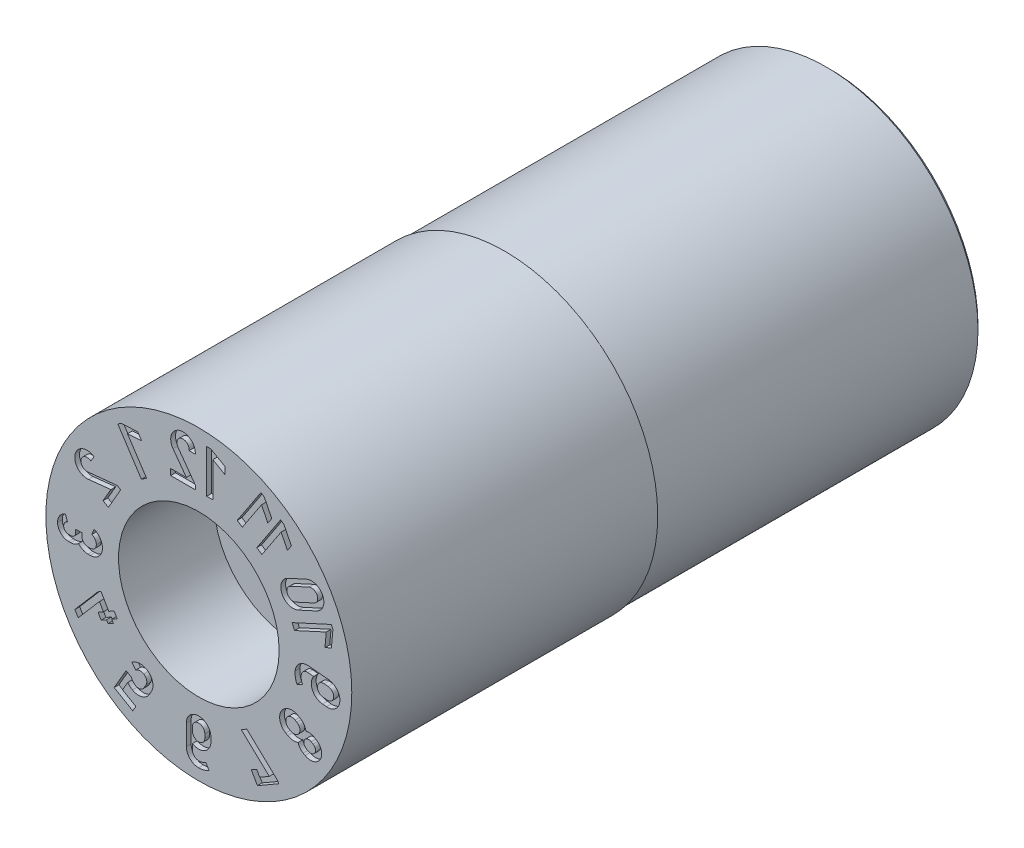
from build123d import *

# Parameters (mm, degrees)
SKETCH4_W          = 17
SKETCH4_H          = 1
CUT_EXTRUDE1_DEPTH = 0.25
CUT_EXTRUDE2_DEPTH = 4


with BuildPart() as part:
    # Sketch1 → Revolve1 (revolve)
    with BuildSketch(Plane(origin=(0, 0, 0), x_dir=(0, 0, -1), z_dir=(1, 0, 0)), mode=Mode.PRIVATE) as revolve1_sk:
        Polygon((0, 8), (0, 4.2), (5, 4.2), (5, 1.75), (25, 1.75), (25, 4), (33, 4), (33, 7.75), (32.75, 8), align=None)
    revolve(revolve1_sk.sketch.rotate(Axis((0, 0, 3.797909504), (0, 0, -1)), 90), axis=Axis((0, 0, 3.797909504), (0, 0, -1)))

    # Sketch4 → Cut-Revolve1 (revolve, cut)
    with BuildSketch(Plane(origin=(0, 0, 0), x_dir=(0, 0, -1), z_dir=(1, 0, 0)), mode=Mode.PRIVATE) as cut_revolve1_sk:
        with Locations((24.5, 8.435)):
            Rectangle(SKETCH4_W, SKETCH4_H)
    revolve(cut_revolve1_sk.sketch.rotate(Axis((0, 0, 0), (0, 0, -1)), 90), axis=Axis((0, 0, 0), (0, 0, -1)), mode=Mode.SUBTRACT)

    # Sketch2 → Cut-Extrude1 (cut)
    # profile 1 of 15: a face of its own
    with BuildSketch(Plane.XY):
        Polygon((4.274261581, 5.964953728), (4.451044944, 5.84811213), (4.840899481, 5.070869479), (4.636190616, 4.761141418), (4.303135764, 5.424889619), (3.300315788, 3.907605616), (3.031794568, 4.085079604), align=None)
    # profile 2 of 15: a face of its own
    with BuildSketch(Plane.XY):
        Polygon((3.249176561, 6.687977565), (3.425959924, 6.571135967), (3.815814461, 5.793893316), (3.611105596, 5.484165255), (3.278050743, 6.147913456), (2.275230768, 4.630629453), (2.006709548, 4.808103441), align=None)
    # profile 3 of 15: a face of its own
    with BuildSketch(Plane.XY):
        with BuildLine():
            Line((6.793989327, -0.014541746), (5.736260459, 0.083976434))
            ThreePointArc((5.736260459, 0.083976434), (5.265501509, -0.061494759), (5.035383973, -0.497180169))
            ThreePointArc((5.035383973, -0.497180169), (5.047437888, -0.783539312), (5.135665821, -1.056234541))
            Line((5.135665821, -1.056234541), (5.426320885, -0.916514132))
            ThreePointArc((5.426320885, -0.916514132), (5.358221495, -0.715172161), (5.359146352, -0.502627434))
            ThreePointArc((5.359146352, -0.502627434), (5.480563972, -0.30152682), (5.706298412, -0.236506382))
            Line((5.706298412, -0.236506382), (6.000494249, -0.263985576))
            ThreePointArc((6.000494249, -0.263985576), (5.939289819, -0.905886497), (6.465951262, -1.277922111))
            Line((6.465951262, -1.277922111), (6.67391746, -1.296603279))
            ThreePointArc((6.67391746, -1.296603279), (7.37498416, -0.715608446), (6.793989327, -0.014541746))
        make_face()
        with BuildLine():
            Line((6.76406797, -0.335199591), (6.555770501, -0.315762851))
            ThreePointArc((6.555770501, -0.315762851), (6.205337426, -0.606388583), (6.495975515, -0.956811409))
            Line((6.495975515, -0.956811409), (6.704227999, -0.976243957))
            ThreePointArc((6.704227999, -0.976243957), (7.054670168, -0.68564176), (6.76406797, -0.335199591))
        make_face(mode=Mode.SUBTRACT)
    # profile 4 of 15: a face of its own
    with BuildSketch(Plane.XY):
        Polygon((2.218221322, -4.564117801), (2.509224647, -4.396106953), (4.103980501, -5.898944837), (4.181225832, -6.032737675), (3.066077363, -6.676568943), (2.744161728, -6.118994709), (3.022987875, -5.958014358), (3.183923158, -6.236762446), (3.685685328, -5.947069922), align=None)
    # profile 5 of 15: a face of its own
    with BuildSketch(Plane.XY):
        with BuildLine():
            Line((5.290596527, -2.496586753), (5.19310719, -2.440197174))
            ThreePointArc((5.19310719, -2.440197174), (4.313170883, -2.675598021), (4.549275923, -3.55534564))
            Line((4.549275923, -3.55534564), (4.646777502, -3.61163819))
            ThreePointArc((4.646777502, -3.61163819), (4.913469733, -3.695545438), (5.190581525, -3.658474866))
            ThreePointArc((5.190581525, -3.658474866), (5.290781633, -3.859082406), (5.459570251, -4.006709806))
            Line((5.459570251, -4.006709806), (5.557170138, -4.062965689))
            ThreePointArc((5.557170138, -4.062965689), (6.34848432, -3.850888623), (6.136407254, -3.059574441))
            Line((6.136407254, -3.059574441), (6.039045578, -3.002946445))
            ThreePointArc((6.039045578, -3.002946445), (5.826909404, -2.93016978), (5.603069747, -2.944098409))
            ThreePointArc((5.603069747, -2.944098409), (5.496600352, -2.685592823), (5.290596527, -2.496586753))
        make_face()
        with BuildLine():
            Line((5.620492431, -3.727955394), (5.718091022, -3.78419986))
            ThreePointArc((5.718091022, -3.78419986), (6.069862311, -3.689943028), (5.975605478, -3.338171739))
            Line((5.975605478, -3.338171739), (5.878097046, -3.281771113))
            ThreePointArc((5.878097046, -3.281771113), (5.525845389, -3.375854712), (5.620492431, -3.727955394))
        make_face(mode=Mode.SUBTRACT)
        with BuildLine():
            Line((4.710158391, -3.276581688), (4.807804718, -3.332957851))
            ThreePointArc((4.807804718, -3.332957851), (5.247474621, -3.215094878), (5.129611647, -2.775424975))
            Line((5.129611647, -2.775424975), (5.032119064, -2.718929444))
            ThreePointArc((5.032119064, -2.718929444), (4.592429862, -2.836842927), (4.710158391, -3.276581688))
        make_face(mode=Mode.SUBTRACT)
    # profile 6 of 15: a face of its own
    with BuildSketch(Plane.XY):
        Polygon((6.924376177, 2.553388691), (7.012820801, 2.36082217), (6.933539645, 1.494908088), (6.59615917, 1.3399513), (6.663755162, 2.079490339), (5.011008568, 1.320393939), (4.876667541, 1.612888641), align=None)
    # profile 7 of 15: a face of its own
    with BuildSketch(Plane.XY):
        with BuildLine():
            Line((5.627518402, 3.955596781), (4.662170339, 3.512218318))
            ThreePointArc((4.662170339, 3.512218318), (4.345757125, 2.658314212), (5.199661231, 2.341900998))
            Line((5.199661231, 2.341900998), (6.16503299, 2.785290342))
            ThreePointArc((6.16503299, 2.785290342), (6.481428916, 3.639200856), (5.627518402, 3.955596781))
        make_face()
        with BuildLine():
            Line((5.065315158, 2.634492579), (6.030686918, 3.077881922))
            ThreePointArc((6.030686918, 3.077881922), (6.188844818, 3.504838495), (5.761897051, 3.663020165))
            Line((5.761897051, 3.663020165), (4.796537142, 3.219636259))
            ThreePointArc((4.796537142, 3.219636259), (4.638343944, 2.79267065), (5.065315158, 2.634492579))
        make_face(mode=Mode.SUBTRACT)
    # profile 8 of 15: a face of its own
    with BuildSketch(Plane.XY):
        Polygon((0.412087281, 7.356987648), (0.623993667, 7.356987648), (1.377789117, 6.923530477), (1.377789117, 6.552266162), (0.733957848, 6.922358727), (0.733957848, 5.103623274), (0.412087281, 5.103623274), align=None)
    # profile 9 of 15: a face of its own
    with BuildSketch(Plane.XY):
        with BuildLine():
            Line((-1.469998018, 5.098686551), (-0.18233548, 5.098686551))
            Line((-0.18233548, 5.098686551), (-0.18233548, 5.311584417))
            Line((-0.18233548, 5.311584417), (-1.087557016, 6.568330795))
            ThreePointArc((-1.087557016, 6.568330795), (-0.901811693, 7.069559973), (-0.507901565, 6.708219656))
            Line((-0.507901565, 6.708219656), (-0.184123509, 6.708211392))
            ThreePointArc((-0.184123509, 6.708211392), (-1.001147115, 7.376125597), (-1.34919274, 6.379882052))
            Line((-1.34919274, 6.379882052), (-0.649052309, 5.420647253))
            Line((-0.649052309, 5.420647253), (-1.469998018, 5.420647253))
            Line((-1.469998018, 5.420647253), (-1.469998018, 5.098686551))
        make_face()
    # profile 10 of 15: a face of its own
    with BuildSketch(Plane.XY):
        Polygon((-4.236413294, 6.052573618), (-4.059109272, 6.168623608), (-3.191019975, 6.218760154), (-2.987698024, 5.908119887), (-3.729077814, 5.865187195), (-2.733052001, 4.343434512), (-3.002364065, 4.16716292), align=None)
    # profile 11 of 15: a face of its own
    with BuildSketch(Plane.XY):
        with BuildLine():
            Line((0.633534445, -5.701190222), (0.63425597, -5.909992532))
            ThreePointArc((0.63425597, -5.909992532), (0.312761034, -6.468941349), (-0.332049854, -6.467639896))
            Line((-0.332049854, -6.467639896), (-0.332076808, -6.763116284))
            ThreePointArc((-0.332076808, -6.763116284), (-0.246364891, -6.981833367), (-0.034853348, -7.084041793))
            ThreePointArc((-0.034853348, -7.084041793), (0.176841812, -7.065218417), (0.370972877, -6.978718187))
            Line((0.370972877, -6.978718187), (0.537132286, -7.255158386))
            ThreePointArc((0.537132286, -7.255158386), (0.273813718, -7.368340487), (-0.010186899, -7.406947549))
            ThreePointArc((-0.010186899, -7.406947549), (-0.46536775, -7.218304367), (-0.653947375, -6.763097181))
            Line((-0.653947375, -6.763097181), (-0.654127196, -5.700750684))
            ThreePointArc((-0.654127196, -5.700750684), (-0.010076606, -5.057139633), (0.633534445, -5.701190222))
        make_face()
        with BuildLine():
            Line((-0.332076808, -5.700790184), (-0.332076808, -5.909992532))
            ThreePointArc((-0.332076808, -5.909992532), (-0.010149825, -6.231908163), (0.311754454, -5.909969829))
            Line((0.311754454, -5.909969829), (0.31175446, -5.700812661))
            ThreePointArc((0.31175446, -5.700812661), (-0.010149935, -5.378885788), (-0.332076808, -5.700790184))
        make_face(mode=Mode.SUBTRACT)
    # profile 12 of 15: a face of its own
    with BuildSketch(Plane.XY):
        with BuildLine():
            Line((-3.714489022, -5.389932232), (-3.98948961, -5.866247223))
            Line((-3.98948961, -5.866247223), (-3.29250531, -6.268651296))
            Line((-3.29250531, -6.268651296), (-3.453493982, -6.547491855))
            Line((-3.453493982, -6.547491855), (-4.429229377, -5.984150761))
            Line((-4.429229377, -5.984150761), (-3.804416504, -4.901943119))
            Line((-3.804416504, -4.901943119), (-3.525668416, -5.062878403))
            ThreePointArc((-3.525668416, -5.062878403), (-3.441654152, -5.216616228), (-3.308352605, -5.330301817))
            ThreePointArc((-3.308352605, -5.330301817), (-3.064092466, -5.362478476), (-2.868684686, -5.212431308))
            Line((-2.868684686, -5.212431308), (-2.76399102, -5.031276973))
            ThreePointArc((-2.76399102, -5.031276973), (-2.731785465, -4.786987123), (-2.881850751, -4.591551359))
            ThreePointArc((-2.881850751, -4.591551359), (-3.094278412, -4.543038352), (-3.297234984, -4.622333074))
            Line((-3.297234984, -4.622333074), (-3.497652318, -4.370071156))
            ThreePointArc((-3.497652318, -4.370071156), (-3.118119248, -4.221675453), (-2.720903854, -4.312706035))
            ThreePointArc((-2.720903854, -4.312706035), (-2.421096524, -4.703701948), (-2.485245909, -5.192217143))
            Line((-2.485245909, -5.192217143), (-2.590049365, -5.373201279))
            ThreePointArc((-2.590049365, -5.373201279), (-2.980973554, -5.672831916), (-3.469366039, -5.609011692))
            ThreePointArc((-3.469366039, -5.609011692), (-3.603331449, -5.512231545), (-3.714489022, -5.389932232))
        make_face()
    # profile 13 of 15: a face of its own
    with BuildSketch(Plane.XY):
        with BuildLine():
            Line((-5.683259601, -0.298372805), (-5.795930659, -0.298372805))
            ThreePointArc((-5.795930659, -0.298372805), (-6.02350028, -0.204110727), (-6.117762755, 0.02345873))
            Line((-6.117762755, 0.02345873), (-6.11776276, 0.184387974))
            Line((-6.11776276, 0.184387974), (-6.439723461, 0.184387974))
            Line((-6.439723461, 0.184387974), (-6.439723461, 0.023497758))
            ThreePointArc((-6.439723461, 0.023497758), (-6.515147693, -0.158592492), (-6.697237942, -0.234016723))
            Line((-6.697237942, -0.234016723), (-6.809893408, -0.234016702))
            ThreePointArc((-6.809893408, -0.234016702), (-6.991919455, -0.158528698), (-7.067420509, 0.023491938))
            ThreePointArc((-7.067420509, 0.023491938), (-7.013162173, 0.192449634), (-6.870475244, 0.297953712))
            Line((-6.870475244, 0.297953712), (-6.973500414, 0.60297294))
            ThreePointArc((-6.973500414, 0.60297294), (-7.2745881, 0.380120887), (-7.389343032, 0.023542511))
            ThreePointArc((-7.389343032, 0.023542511), (-7.219656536, -0.38626383), (-6.809861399, -0.555977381))
            Line((-6.809861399, -0.555977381), (-6.697237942, -0.555977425))
            ThreePointArc((-6.697237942, -0.555977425), (-6.477305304, -0.512596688), (-6.290317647, -0.388952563))
            ThreePointArc((-6.290317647, -0.388952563), (-6.068864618, -0.559657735), (-5.795917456, -0.620333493))
            Line((-5.795917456, -0.620333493), (-5.683205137, -0.620333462))
            ThreePointArc((-5.683205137, -0.620333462), (-5.227993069, -0.431759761), (-5.03948293, 0.023478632))
            ThreePointArc((-5.03948293, 0.023478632), (-5.159426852, 0.412852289), (-5.477607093, 0.667331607))
            Line((-5.477607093, 0.667331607), (-5.595721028, 0.367959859))
            ThreePointArc((-5.595721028, 0.367959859), (-5.425502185, 0.231834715), (-5.361353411, 0.023533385))
            ThreePointArc((-5.361353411, 0.023533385), (-5.455637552, -0.204088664), (-5.683259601, -0.298372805))
        make_face()
    # profile 14 of 15: a face of its own
    with BuildSketch(Plane.XY):
        Polygon((-6.480099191, -3.467598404), (-6.309609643, -3.762894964), (-5.197383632, -2.470260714), (-4.988857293, -2.831438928), (-5.267605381, -2.992374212), (-5.106670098, -3.2711223), (-4.82792201, -3.110187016), (-4.747431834, -3.249600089), (-4.468683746, -3.088664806), (-4.549173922, -2.949251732), (-4.270347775, -2.788271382), (-4.431283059, -2.509523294), (-4.710109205, -2.670503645), (-5.112515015, -1.973516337), (-5.275501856, -2.067616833), align=None)
    # profile 15 of 15: a face of its own
    with BuildSketch(Plane.XY):
        with BuildLine():
            Line((-5.009271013, 2.190110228), (-4.730444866, 2.029129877))
            Line((-4.730444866, 2.029129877), (-4.08661297, 3.144279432))
            Line((-4.08661297, 3.144279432), (-4.270984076, 3.25072614))
            Line((-4.270984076, 3.25072614), (-5.811969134, 3.095154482))
            ThreePointArc((-5.811969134, 3.095154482), (-6.153157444, 3.506610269), (-5.643295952, 3.667067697))
            Line((-5.643295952, 3.667067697), (-5.481407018, 3.947482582))
            ThreePointArc((-5.481407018, 3.947482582), (-6.468331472, 3.573873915), (-5.779590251, 2.774349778))
            Line((-5.779590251, 2.774349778), (-4.598798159, 2.901070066))
            Line((-4.598798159, 2.901070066), (-5.009271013, 2.190110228))
        make_face()
    extrude(amount=-CUT_EXTRUDE1_DEPTH, mode=Mode.SUBTRACT)

    # Sketch3 → Cut-Extrude2 (cut)
    with BuildSketch(Plane.XY.offset(-5)):
        Polygon((1.010362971, 1.75), (-1.010362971, 1.75), (-2.020725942, 0), (-1.010362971, -1.75), (1.010362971, -1.75), (2.020725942, 0), align=None)
    extrude(amount=-CUT_EXTRUDE2_DEPTH, mode=Mode.SUBTRACT)


solid = part.part
